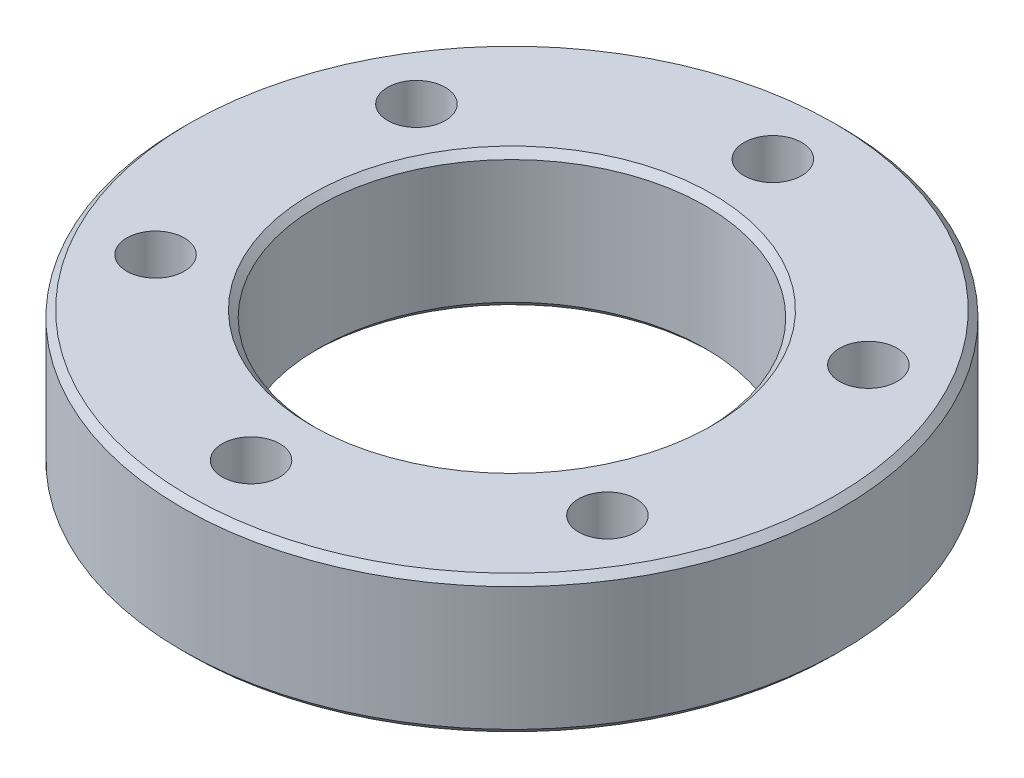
from build123d import *

# Parameters (mm, degrees)
ESQUISSE1_R                  = 24
ESQUISSE1_R_2                = 14.1
BOSS_EXTRU_1_DEPTH           = 10
TROU_TARAUD_M51_D            = 4.2
R_P_TITION_CIRCULAIRE1_COUNT = 6
CHANFREIN1_SIZE              = 0.5


with BuildPart() as part:
    # Esquisse1 → Boss.-Extru.1 (new body)
    with BuildSketch(Plane(origin=(0, 0, 0), x_dir=(1, 0, 0), z_dir=(0, 1, 0))):
        with Locations(Location((0, 0, 0), (0, 0, 270))):
            Circle(ESQUISSE1_R)
        with Locations(Location((0, 0, 0), (0, 0, 270))):
            Circle(ESQUISSE1_R_2, mode=Mode.SUBTRACT)
    extrude(amount=BOSS_EXTRU_1_DEPTH)

    # Trou taraud_ M51 (through all)
    with Locations(Plane(origin=(0, 10, 0), x_dir=(1, 0, 0), z_dir=(0, 1, 0))):
        with Locations((0, 19)):
            trou_taraud_m51 = Hole(TROU_TARAUD_M51_D / 2)

    # R_p_tition circulaire1: Trou taraud_ M51 ×6 about axis
    r_p_tition_circulaire1_axis = Axis((0, 0, 0), (0, 1, 0))
    for i in range(1, R_P_TITION_CIRCULAIRE1_COUNT):
        add(trou_taraud_m51.rotate(r_p_tition_circulaire1_axis, i * 360 / R_P_TITION_CIRCULAIRE1_COUNT), mode=Mode.SUBTRACT)

    # Chanfrein1
    chanfrein1_edges = [part.edges().sort_by_distance(p)[0] for p in [
        (0, 0, -24),
        (0, 10, -24),
        (0, 0, -14.1),
        (0, 10, -14.1),
    ]]
    chamfer(chanfrein1_edges, length=CHANFREIN1_SIZE)


solid = part.part
